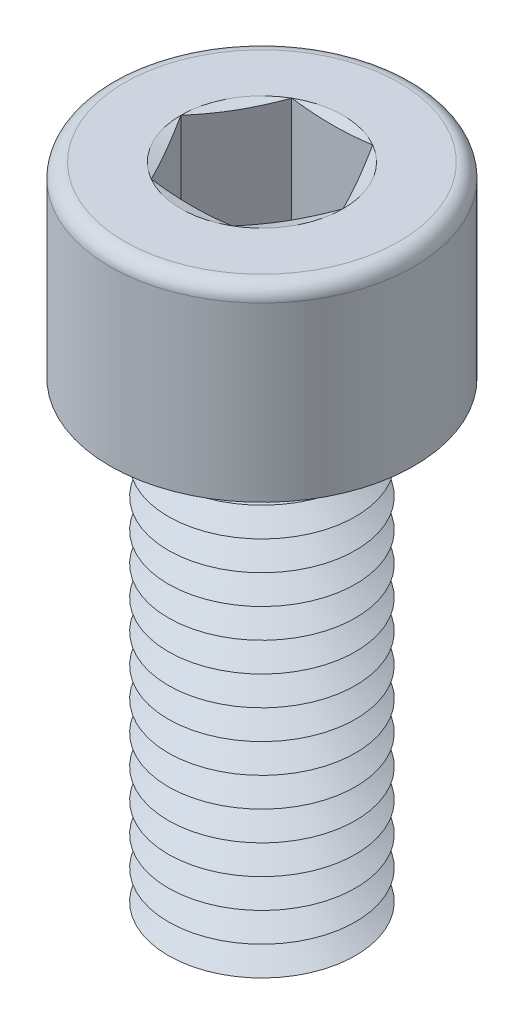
ISO-10303-21;
HEADER;
FILE_DESCRIPTION(('STEP AP214'),'2;1');
FILE_NAME('part.step','',(''),(''),'','','');
FILE_SCHEMA(('AUTOMOTIVE_DESIGN { 1 0 10303 214 1 1 1 1 }'));
ENDSEC;
DATA;
#1=APPLICATION_CONTEXT('core data for automotive mechanical design processes');
#2=APPLICATION_PROTOCOL_DEFINITION('international standard','automotive_design',2000,#1);
#3=PRODUCT_CONTEXT('',#1,'mechanical');
#4=PRODUCT('Part','Part','',(#3));
#5=PRODUCT_RELATED_PRODUCT_CATEGORY('part','',(#4));
#6=PRODUCT_DEFINITION_FORMATION('','',#4);
#7=PRODUCT_DEFINITION_CONTEXT('part definition',#1,'design');
#8=PRODUCT_DEFINITION('design','',#6,#7);
#9=PRODUCT_DEFINITION_SHAPE('','',#8);
#10=(LENGTH_UNIT() NAMED_UNIT(*) SI_UNIT(.MILLI.,.METRE.));
#11=(NAMED_UNIT(*) PLANE_ANGLE_UNIT() SI_UNIT($,.RADIAN.));
#12=(NAMED_UNIT(*) SI_UNIT($,.STERADIAN.) SOLID_ANGLE_UNIT());
#13=UNCERTAINTY_MEASURE_WITH_UNIT(LENGTH_MEASURE(1.E-05),#10,'distance_accuracy_value','');
#14=(GEOMETRIC_REPRESENTATION_CONTEXT(3) GLOBAL_UNCERTAINTY_ASSIGNED_CONTEXT((#13)) GLOBAL_UNIT_ASSIGNED_CONTEXT((#10,
#11,#12)) REPRESENTATION_CONTEXT('',''));
#15=CARTESIAN_POINT('',(0.,0.,0.));
#16=DIRECTION('',(0.,0.,1.));
#17=DIRECTION('',(1.,0.,0.));
#18=AXIS2_PLACEMENT_3D('',#15,#16,#17);
#19=CARTESIAN_POINT('',(0.,5.,0.));
#20=DIRECTION('',(0.,1.,0.));
#21=DIRECTION('',(0.,0.,1.));
#22=AXIS2_PLACEMENT_3D('',#19,#20,#21);
#23=CONICAL_SURFACE('',#22,2.91746824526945,1.0471975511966);
#24=CARTESIAN_POINT('',(0.,5.625,0.));
#25=DIRECTION('',(0.,1.,0.));
#26=DIRECTION('',(0.,0.,1.));
#27=AXIS2_PLACEMENT_3D('',#24,#25,#26);
#28=CIRCLE('',#27,4.);
#29=CARTESIAN_POINT('',(0.,5.625,4.));
#30=VERTEX_POINT('',#29);
#31=EDGE_CURVE('E437',#30,#30,#28,.T.);
#32=ORIENTED_EDGE('',*,*,#31,.F.);
#33=EDGE_LOOP('',(#32));
#34=FACE_BOUND('',#33,.T.);
#35=CARTESIAN_POINT('',(0.,5.,0.));
#36=DIRECTION('',(0.,1.,0.));
#37=DIRECTION('',(0.,0.,1.));
#38=AXIS2_PLACEMENT_3D('',#35,#36,#37);
#39=CIRCLE('',#38,2.91746824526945);
#40=CARTESIAN_POINT('',(0.,5.,2.91746824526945));
#41=VERTEX_POINT('',#40);
#42=EDGE_CURVE('E441',#41,#41,#39,.T.);
#43=ORIENTED_EDGE('',*,*,#42,.T.);
#44=EDGE_LOOP('',(#43));
#45=FACE_BOUND('',#44,.T.);
#46=ADVANCED_FACE('F41',(#34,#45),#23,.T.);
#47=CARTESIAN_POINT('',(0.,4.375,0.));
#48=DIRECTION('',(0.,-1.,0.));
#49=DIRECTION('',(0.,0.,-1.));
#50=AXIS2_PLACEMENT_3D('',#47,#48,#49);
#51=CONICAL_SURFACE('',#50,4.,1.0471975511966);
#52=ORIENTED_EDGE('',*,*,#42,.F.);
#53=EDGE_LOOP('',(#52));
#54=FACE_BOUND('',#53,.T.);
#55=CARTESIAN_POINT('',(0.,4.375,0.));
#56=DIRECTION('',(0.,1.,0.));
#57=DIRECTION('',(0.,0.,1.));
#58=AXIS2_PLACEMENT_3D('',#55,#56,#57);
#59=CIRCLE('',#58,4.);
#60=CARTESIAN_POINT('',(0.,4.375,4.));
#61=VERTEX_POINT('',#60);
#62=EDGE_CURVE('E445',#61,#61,#59,.T.);
#63=ORIENTED_EDGE('',*,*,#62,.T.);
#64=EDGE_LOOP('',(#63));
#65=FACE_BOUND('',#64,.T.);
#66=ADVANCED_FACE('F250',(#54,#65),#51,.T.);
#67=CARTESIAN_POINT('',(0.,0.,0.));
#68=DIRECTION('',(0.,1.,0.));
#69=DIRECTION('',(0.,0.,1.));
#70=AXIS2_PLACEMENT_3D('',#67,#68,#69);
#71=PLANE('',#70);
#72=CARTESIAN_POINT('',(0.,0.,0.));
#73=DIRECTION('',(0.,1.,0.));
#74=DIRECTION('',(0.,0.,1.));
#75=AXIS2_PLACEMENT_3D('',#72,#73,#74);
#76=CIRCLE('',#75,2.91746824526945);
#77=CARTESIAN_POINT('',(0.,0.,2.91746824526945));
#78=VERTEX_POINT('',#77);
#79=EDGE_CURVE('E473',#78,#78,#76,.T.);
#80=ORIENTED_EDGE('',*,*,#79,.F.);
#81=EDGE_LOOP('',(#80));
#82=FACE_BOUND('',#81,.T.);
#83=ADVANCED_FACE('F247',(#82),#71,.F.);
#84=CARTESIAN_POINT('',(0.,0.,0.));
#85=DIRECTION('',(0.,1.,0.));
#86=DIRECTION('',(0.,0.,1.));
#87=AXIS2_PLACEMENT_3D('',#84,#85,#86);
#88=CONICAL_SURFACE('',#87,2.91746824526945,1.0471975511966);
#89=CARTESIAN_POINT('',(0.,0.624999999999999,0.));
#90=DIRECTION('',(0.,1.,0.));
#91=DIRECTION('',(0.,0.,1.));
#92=AXIS2_PLACEMENT_3D('',#89,#90,#91);
#93=CIRCLE('',#92,4.);
#94=CARTESIAN_POINT('',(0.,0.624999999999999,4.));
#95=VERTEX_POINT('',#94);
#96=EDGE_CURVE('E469',#95,#95,#93,.T.);
#97=ORIENTED_EDGE('',*,*,#96,.F.);
#98=EDGE_LOOP('',(#97));
#99=FACE_BOUND('',#98,.T.);
#100=ORIENTED_EDGE('',*,*,#79,.T.);
#101=EDGE_LOOP('',(#100));
#102=FACE_BOUND('',#101,.T.);
#103=ADVANCED_FACE('F249',(#99,#102),#88,.T.);
#104=CARTESIAN_POINT('',(0.,0.624999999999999,0.));
#105=DIRECTION('',(0.,-1.,0.));
#106=DIRECTION('',(0.,0.,-1.));
#107=AXIS2_PLACEMENT_3D('',#104,#105,#106);
#108=CONICAL_SURFACE('',#107,4.,1.0471975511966);
#109=CARTESIAN_POINT('',(0.,1.25,0.));
#110=DIRECTION('',(0.,1.,0.));
#111=DIRECTION('',(0.,0.,1.));
#112=AXIS2_PLACEMENT_3D('',#109,#110,#111);
#113=CIRCLE('',#112,2.91746824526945);
#114=CARTESIAN_POINT('',(0.,1.25,2.91746824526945));
#115=VERTEX_POINT('',#114);
#116=EDGE_CURVE('E465',#115,#115,#113,.T.);
#117=ORIENTED_EDGE('',*,*,#116,.F.);
#118=EDGE_LOOP('',(#117));
#119=FACE_BOUND('',#118,.T.);
#120=ORIENTED_EDGE('',*,*,#96,.T.);
#121=EDGE_LOOP('',(#120));
#122=FACE_BOUND('',#121,.T.);
#123=ADVANCED_FACE('F290',(#119,#122),#108,.T.);
#124=CARTESIAN_POINT('',(0.,1.25,0.));
#125=DIRECTION('',(0.,1.,0.));
#126=DIRECTION('',(0.,0.,1.));
#127=AXIS2_PLACEMENT_3D('',#124,#125,#126);
#128=CONICAL_SURFACE('',#127,2.91746824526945,1.0471975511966);
#129=CARTESIAN_POINT('',(0.,1.875,0.));
#130=DIRECTION('',(0.,1.,0.));
#131=DIRECTION('',(0.,0.,1.));
#132=AXIS2_PLACEMENT_3D('',#129,#130,#131);
#133=CIRCLE('',#132,4.);
#134=CARTESIAN_POINT('',(0.,1.875,4.));
#135=VERTEX_POINT('',#134);
#136=EDGE_CURVE('E461',#135,#135,#133,.T.);
#137=ORIENTED_EDGE('',*,*,#136,.F.);
#138=EDGE_LOOP('',(#137));
#139=FACE_BOUND('',#138,.T.);
#140=ORIENTED_EDGE('',*,*,#116,.T.);
#141=EDGE_LOOP('',(#140));
#142=FACE_BOUND('',#141,.T.);
#143=ADVANCED_FACE('F285',(#139,#142),#128,.T.);
#144=CARTESIAN_POINT('',(0.,1.875,0.));
#145=DIRECTION('',(0.,-1.,0.));
#146=DIRECTION('',(0.,0.,-1.));
#147=AXIS2_PLACEMENT_3D('',#144,#145,#146);
#148=CONICAL_SURFACE('',#147,4.,1.0471975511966);
#149=CARTESIAN_POINT('',(0.,2.5,0.));
#150=DIRECTION('',(0.,1.,0.));
#151=DIRECTION('',(0.,0.,1.));
#152=AXIS2_PLACEMENT_3D('',#149,#150,#151);
#153=CIRCLE('',#152,2.91746824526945);
#154=CARTESIAN_POINT('',(0.,2.5,2.91746824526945));
#155=VERTEX_POINT('',#154);
#156=EDGE_CURVE('E457',#155,#155,#153,.T.);
#157=ORIENTED_EDGE('',*,*,#156,.F.);
#158=EDGE_LOOP('',(#157));
#159=FACE_BOUND('',#158,.T.);
#160=ORIENTED_EDGE('',*,*,#136,.T.);
#161=EDGE_LOOP('',(#160));
#162=FACE_BOUND('',#161,.T.);
#163=ADVANCED_FACE('F282',(#159,#162),#148,.T.);
#164=CARTESIAN_POINT('',(0.,2.5,0.));
#165=DIRECTION('',(0.,1.,0.));
#166=DIRECTION('',(0.,0.,1.));
#167=AXIS2_PLACEMENT_3D('',#164,#165,#166);
#168=CONICAL_SURFACE('',#167,2.91746824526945,1.0471975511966);
#169=CARTESIAN_POINT('',(0.,3.125,0.));
#170=DIRECTION('',(0.,1.,0.));
#171=DIRECTION('',(0.,0.,1.));
#172=AXIS2_PLACEMENT_3D('',#169,#170,#171);
#173=CIRCLE('',#172,4.);
#174=CARTESIAN_POINT('',(0.,3.125,4.));
#175=VERTEX_POINT('',#174);
#176=EDGE_CURVE('E453',#175,#175,#173,.T.);
#177=ORIENTED_EDGE('',*,*,#176,.F.);
#178=EDGE_LOOP('',(#177));
#179=FACE_BOUND('',#178,.T.);
#180=ORIENTED_EDGE('',*,*,#156,.T.);
#181=EDGE_LOOP('',(#180));
#182=FACE_BOUND('',#181,.T.);
#183=ADVANCED_FACE('F276',(#179,#182),#168,.T.);
#184=CARTESIAN_POINT('',(0.,3.125,0.));
#185=DIRECTION('',(0.,-1.,0.));
#186=DIRECTION('',(0.,0.,-1.));
#187=AXIS2_PLACEMENT_3D('',#184,#185,#186);
#188=CONICAL_SURFACE('',#187,4.,1.0471975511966);
#189=CARTESIAN_POINT('',(0.,3.75,0.));
#190=DIRECTION('',(0.,1.,0.));
#191=DIRECTION('',(0.,0.,1.));
#192=AXIS2_PLACEMENT_3D('',#189,#190,#191);
#193=CIRCLE('',#192,2.91746824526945);
#194=CARTESIAN_POINT('',(0.,3.75,2.91746824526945));
#195=VERTEX_POINT('',#194);
#196=EDGE_CURVE('E449',#195,#195,#193,.T.);
#197=ORIENTED_EDGE('',*,*,#196,.F.);
#198=EDGE_LOOP('',(#197));
#199=FACE_BOUND('',#198,.T.);
#200=ORIENTED_EDGE('',*,*,#176,.T.);
#201=EDGE_LOOP('',(#200));
#202=FACE_BOUND('',#201,.T.);
#203=ADVANCED_FACE('F272',(#199,#202),#188,.T.);
#204=CARTESIAN_POINT('',(0.,3.75,0.));
#205=DIRECTION('',(0.,1.,0.));
#206=DIRECTION('',(0.,0.,1.));
#207=AXIS2_PLACEMENT_3D('',#204,#205,#206);
#208=CONICAL_SURFACE('',#207,2.91746824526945,1.0471975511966);
#209=ORIENTED_EDGE('',*,*,#62,.F.);
#210=EDGE_LOOP('',(#209));
#211=FACE_BOUND('',#210,.T.);
#212=ORIENTED_EDGE('',*,*,#196,.T.);
#213=EDGE_LOOP('',(#212));
#214=FACE_BOUND('',#213,.T.);
#215=ADVANCED_FACE('F275',(#211,#214),#208,.T.);
#216=CARTESIAN_POINT('',(0.,6.25,0.));
#217=DIRECTION('',(0.,1.,0.));
#218=DIRECTION('',(0.,0.,1.));
#219=AXIS2_PLACEMENT_3D('',#216,#217,#218);
#220=CONICAL_SURFACE('',#219,2.91746824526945,1.0471975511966);
#221=CARTESIAN_POINT('',(0.,6.875,0.));
#222=DIRECTION('',(0.,1.,0.));
#223=DIRECTION('',(0.,0.,1.));
#224=AXIS2_PLACEMENT_3D('',#221,#222,#223);
#225=CIRCLE('',#224,4.);
#226=CARTESIAN_POINT('',(0.,6.875,4.));
#227=VERTEX_POINT('',#226);
#228=EDGE_CURVE('E430',#227,#227,#225,.T.);
#229=ORIENTED_EDGE('',*,*,#228,.F.);
#230=EDGE_LOOP('',(#229));
#231=FACE_BOUND('',#230,.T.);
#232=CARTESIAN_POINT('',(0.,6.25,0.));
#233=DIRECTION('',(0.,1.,0.));
#234=DIRECTION('',(0.,0.,1.));
#235=AXIS2_PLACEMENT_3D('',#232,#233,#234);
#236=CIRCLE('',#235,2.91746824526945);
#237=CARTESIAN_POINT('',(0.,6.25,2.91746824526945));
#238=VERTEX_POINT('',#237);
#239=EDGE_CURVE('E433',#238,#238,#236,.T.);
#240=ORIENTED_EDGE('',*,*,#239,.T.);
#241=EDGE_LOOP('',(#240));
#242=FACE_BOUND('',#241,.T.);
#243=ADVANCED_FACE('F280',(#231,#242),#220,.T.);
#244=CARTESIAN_POINT('',(0.,5.625,0.));
#245=DIRECTION('',(0.,-1.,0.));
#246=DIRECTION('',(0.,0.,-1.));
#247=AXIS2_PLACEMENT_3D('',#244,#245,#246);
#248=CONICAL_SURFACE('',#247,4.,1.0471975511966);
#249=ORIENTED_EDGE('',*,*,#239,.F.);
#250=EDGE_LOOP('',(#249));
#251=FACE_BOUND('',#250,.T.);
#252=ORIENTED_EDGE('',*,*,#31,.T.);
#253=EDGE_LOOP('',(#252));
#254=FACE_BOUND('',#253,.T.);
#255=ADVANCED_FACE('F717',(#251,#254),#248,.T.);
#256=CARTESIAN_POINT('',(0.,7.5,0.));
#257=DIRECTION('',(0.,1.,0.));
#258=DIRECTION('',(0.,0.,1.));
#259=AXIS2_PLACEMENT_3D('',#256,#257,#258);
#260=CONICAL_SURFACE('',#259,2.91746824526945,1.0471975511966);
#261=CARTESIAN_POINT('',(0.,8.125,0.));
#262=DIRECTION('',(0.,1.,0.));
#263=DIRECTION('',(0.,0.,1.));
#264=AXIS2_PLACEMENT_3D('',#261,#262,#263);
#265=CIRCLE('',#264,4.);
#266=CARTESIAN_POINT('',(0.,8.125,4.));
#267=VERTEX_POINT('',#266);
#268=EDGE_CURVE('E422',#267,#267,#265,.T.);
#269=ORIENTED_EDGE('',*,*,#268,.F.);
#270=EDGE_LOOP('',(#269));
#271=FACE_BOUND('',#270,.T.);
#272=CARTESIAN_POINT('',(0.,7.5,0.));
#273=DIRECTION('',(0.,1.,0.));
#274=DIRECTION('',(0.,0.,1.));
#275=AXIS2_PLACEMENT_3D('',#272,#273,#274);
#276=CIRCLE('',#275,2.91746824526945);
#277=CARTESIAN_POINT('',(0.,7.5,2.91746824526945));
#278=VERTEX_POINT('',#277);
#279=EDGE_CURVE('E426',#278,#278,#276,.T.);
#280=ORIENTED_EDGE('',*,*,#279,.T.);
#281=EDGE_LOOP('',(#280));
#282=FACE_BOUND('',#281,.T.);
#283=ADVANCED_FACE('F726',(#271,#282),#260,.T.);
#284=CARTESIAN_POINT('',(0.,6.875,0.));
#285=DIRECTION('',(0.,-1.,0.));
#286=DIRECTION('',(0.,0.,-1.));
#287=AXIS2_PLACEMENT_3D('',#284,#285,#286);
#288=CONICAL_SURFACE('',#287,4.,1.0471975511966);
#289=ORIENTED_EDGE('',*,*,#279,.F.);
#290=EDGE_LOOP('',(#289));
#291=FACE_BOUND('',#290,.T.);
#292=ORIENTED_EDGE('',*,*,#228,.T.);
#293=EDGE_LOOP('',(#292));
#294=FACE_BOUND('',#293,.T.);
#295=ADVANCED_FACE('F736',(#291,#294),#288,.T.);
#296=CARTESIAN_POINT('',(0.,8.75,0.));
#297=DIRECTION('',(0.,1.,0.));
#298=DIRECTION('',(0.,0.,1.));
#299=AXIS2_PLACEMENT_3D('',#296,#297,#298);
#300=CONICAL_SURFACE('',#299,2.91746824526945,1.0471975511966);
#301=CARTESIAN_POINT('',(0.,9.375,0.));
#302=DIRECTION('',(0.,1.,0.));
#303=DIRECTION('',(0.,0.,1.));
#304=AXIS2_PLACEMENT_3D('',#301,#302,#303);
#305=CIRCLE('',#304,4.);
#306=CARTESIAN_POINT('',(0.,9.375,4.));
#307=VERTEX_POINT('',#306);
#308=EDGE_CURVE('E414',#307,#307,#305,.T.);
#309=ORIENTED_EDGE('',*,*,#308,.F.);
#310=EDGE_LOOP('',(#309));
#311=FACE_BOUND('',#310,.T.);
#312=CARTESIAN_POINT('',(0.,8.75,0.));
#313=DIRECTION('',(0.,1.,0.));
#314=DIRECTION('',(0.,0.,1.));
#315=AXIS2_PLACEMENT_3D('',#312,#313,#314);
#316=CIRCLE('',#315,2.91746824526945);
#317=CARTESIAN_POINT('',(0.,8.75,2.91746824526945));
#318=VERTEX_POINT('',#317);
#319=EDGE_CURVE('E418',#318,#318,#316,.T.);
#320=ORIENTED_EDGE('',*,*,#319,.T.);
#321=EDGE_LOOP('',(#320));
#322=FACE_BOUND('',#321,.T.);
#323=ADVANCED_FACE('F746',(#311,#322),#300,.T.);
#324=CARTESIAN_POINT('',(0.,8.125,0.));
#325=DIRECTION('',(0.,-1.,0.));
#326=DIRECTION('',(0.,0.,-1.));
#327=AXIS2_PLACEMENT_3D('',#324,#325,#326);
#328=CONICAL_SURFACE('',#327,4.,1.0471975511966);
#329=ORIENTED_EDGE('',*,*,#319,.F.);
#330=EDGE_LOOP('',(#329));
#331=FACE_BOUND('',#330,.T.);
#332=ORIENTED_EDGE('',*,*,#268,.T.);
#333=EDGE_LOOP('',(#332));
#334=FACE_BOUND('',#333,.T.);
#335=ADVANCED_FACE('F756',(#331,#334),#328,.T.);
#336=CARTESIAN_POINT('',(0.,10.,0.));
#337=DIRECTION('',(0.,1.,0.));
#338=DIRECTION('',(0.,0.,1.));
#339=AXIS2_PLACEMENT_3D('',#336,#337,#338);
#340=CONICAL_SURFACE('',#339,2.91746824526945,1.0471975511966);
#341=CARTESIAN_POINT('',(0.,10.625,0.));
#342=DIRECTION('',(0.,1.,0.));
#343=DIRECTION('',(0.,0.,1.));
#344=AXIS2_PLACEMENT_3D('',#341,#342,#343);
#345=CIRCLE('',#344,4.);
#346=CARTESIAN_POINT('',(0.,10.625,4.));
#347=VERTEX_POINT('',#346);
#348=EDGE_CURVE('E406',#347,#347,#345,.T.);
#349=ORIENTED_EDGE('',*,*,#348,.F.);
#350=EDGE_LOOP('',(#349));
#351=FACE_BOUND('',#350,.T.);
#352=CARTESIAN_POINT('',(0.,10.,0.));
#353=DIRECTION('',(0.,1.,0.));
#354=DIRECTION('',(0.,0.,1.));
#355=AXIS2_PLACEMENT_3D('',#352,#353,#354);
#356=CIRCLE('',#355,2.91746824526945);
#357=CARTESIAN_POINT('',(0.,10.,2.91746824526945));
#358=VERTEX_POINT('',#357);
#359=EDGE_CURVE('E410',#358,#358,#356,.T.);
#360=ORIENTED_EDGE('',*,*,#359,.T.);
#361=EDGE_LOOP('',(#360));
#362=FACE_BOUND('',#361,.T.);
#363=ADVANCED_FACE('F766',(#351,#362),#340,.T.);
#364=CARTESIAN_POINT('',(0.,9.375,0.));
#365=DIRECTION('',(0.,-1.,0.));
#366=DIRECTION('',(0.,0.,-1.));
#367=AXIS2_PLACEMENT_3D('',#364,#365,#366);
#368=CONICAL_SURFACE('',#367,4.,1.0471975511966);
#369=ORIENTED_EDGE('',*,*,#359,.F.);
#370=EDGE_LOOP('',(#369));
#371=FACE_BOUND('',#370,.T.);
#372=ORIENTED_EDGE('',*,*,#308,.T.);
#373=EDGE_LOOP('',(#372));
#374=FACE_BOUND('',#373,.T.);
#375=ADVANCED_FACE('F776',(#371,#374),#368,.T.);
#376=CARTESIAN_POINT('',(0.,11.25,0.));
#377=DIRECTION('',(0.,1.,0.));
#378=DIRECTION('',(0.,0.,1.));
#379=AXIS2_PLACEMENT_3D('',#376,#377,#378);
#380=CONICAL_SURFACE('',#379,2.91746824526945,1.0471975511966);
#381=CARTESIAN_POINT('',(0.,11.875,0.));
#382=DIRECTION('',(0.,1.,0.));
#383=DIRECTION('',(0.,0.,1.));
#384=AXIS2_PLACEMENT_3D('',#381,#382,#383);
#385=CIRCLE('',#384,4.);
#386=CARTESIAN_POINT('',(0.,11.875,4.));
#387=VERTEX_POINT('',#386);
#388=EDGE_CURVE('E398',#387,#387,#385,.T.);
#389=ORIENTED_EDGE('',*,*,#388,.F.);
#390=EDGE_LOOP('',(#389));
#391=FACE_BOUND('',#390,.T.);
#392=CARTESIAN_POINT('',(0.,11.25,0.));
#393=DIRECTION('',(0.,1.,0.));
#394=DIRECTION('',(0.,0.,1.));
#395=AXIS2_PLACEMENT_3D('',#392,#393,#394);
#396=CIRCLE('',#395,2.91746824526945);
#397=CARTESIAN_POINT('',(0.,11.25,2.91746824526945));
#398=VERTEX_POINT('',#397);
#399=EDGE_CURVE('E402',#398,#398,#396,.T.);
#400=ORIENTED_EDGE('',*,*,#399,.T.);
#401=EDGE_LOOP('',(#400));
#402=FACE_BOUND('',#401,.T.);
#403=ADVANCED_FACE('F786',(#391,#402),#380,.T.);
#404=CARTESIAN_POINT('',(0.,10.625,0.));
#405=DIRECTION('',(0.,-1.,0.));
#406=DIRECTION('',(0.,0.,-1.));
#407=AXIS2_PLACEMENT_3D('',#404,#405,#406);
#408=CONICAL_SURFACE('',#407,4.,1.0471975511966);
#409=ORIENTED_EDGE('',*,*,#399,.F.);
#410=EDGE_LOOP('',(#409));
#411=FACE_BOUND('',#410,.T.);
#412=ORIENTED_EDGE('',*,*,#348,.T.);
#413=EDGE_LOOP('',(#412));
#414=FACE_BOUND('',#413,.T.);
#415=ADVANCED_FACE('F796',(#411,#414),#408,.T.);
#416=CARTESIAN_POINT('',(0.,12.5,0.));
#417=DIRECTION('',(0.,1.,0.));
#418=DIRECTION('',(0.,0.,1.));
#419=AXIS2_PLACEMENT_3D('',#416,#417,#418);
#420=CONICAL_SURFACE('',#419,2.91746824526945,1.0471975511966);
#421=CARTESIAN_POINT('',(0.,13.125,0.));
#422=DIRECTION('',(0.,1.,0.));
#423=DIRECTION('',(0.,0.,1.));
#424=AXIS2_PLACEMENT_3D('',#421,#422,#423);
#425=CIRCLE('',#424,4.);
#426=CARTESIAN_POINT('',(0.,13.125,4.));
#427=VERTEX_POINT('',#426);
#428=EDGE_CURVE('E390',#427,#427,#425,.T.);
#429=ORIENTED_EDGE('',*,*,#428,.F.);
#430=EDGE_LOOP('',(#429));
#431=FACE_BOUND('',#430,.T.);
#432=CARTESIAN_POINT('',(0.,12.5,0.));
#433=DIRECTION('',(0.,1.,0.));
#434=DIRECTION('',(0.,0.,1.));
#435=AXIS2_PLACEMENT_3D('',#432,#433,#434);
#436=CIRCLE('',#435,2.91746824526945);
#437=CARTESIAN_POINT('',(0.,12.5,2.91746824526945));
#438=VERTEX_POINT('',#437);
#439=EDGE_CURVE('E394',#438,#438,#436,.T.);
#440=ORIENTED_EDGE('',*,*,#439,.T.);
#441=EDGE_LOOP('',(#440));
#442=FACE_BOUND('',#441,.T.);
#443=ADVANCED_FACE('F806',(#431,#442),#420,.T.);
#444=CARTESIAN_POINT('',(0.,11.875,0.));
#445=DIRECTION('',(0.,-1.,0.));
#446=DIRECTION('',(0.,0.,-1.));
#447=AXIS2_PLACEMENT_3D('',#444,#445,#446);
#448=CONICAL_SURFACE('',#447,4.,1.0471975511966);
#449=ORIENTED_EDGE('',*,*,#439,.F.);
#450=EDGE_LOOP('',(#449));
#451=FACE_BOUND('',#450,.T.);
#452=ORIENTED_EDGE('',*,*,#388,.T.);
#453=EDGE_LOOP('',(#452));
#454=FACE_BOUND('',#453,.T.);
#455=ADVANCED_FACE('F816',(#451,#454),#448,.T.);
#456=CARTESIAN_POINT('',(0.,13.75,0.));
#457=DIRECTION('',(0.,1.,0.));
#458=DIRECTION('',(0.,0.,1.));
#459=AXIS2_PLACEMENT_3D('',#456,#457,#458);
#460=CONICAL_SURFACE('',#459,2.91746824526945,1.0471975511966);
#461=CARTESIAN_POINT('',(0.,14.375,0.));
#462=DIRECTION('',(0.,1.,0.));
#463=DIRECTION('',(0.,0.,1.));
#464=AXIS2_PLACEMENT_3D('',#461,#462,#463);
#465=CIRCLE('',#464,4.);
#466=CARTESIAN_POINT('',(0.,14.375,4.));
#467=VERTEX_POINT('',#466);
#468=EDGE_CURVE('E383',#467,#467,#465,.T.);
#469=ORIENTED_EDGE('',*,*,#468,.F.);
#470=EDGE_LOOP('',(#469));
#471=FACE_BOUND('',#470,.T.);
#472=CARTESIAN_POINT('',(0.,13.75,0.));
#473=DIRECTION('',(0.,1.,0.));
#474=DIRECTION('',(0.,0.,1.));
#475=AXIS2_PLACEMENT_3D('',#472,#473,#474);
#476=CIRCLE('',#475,2.91746824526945);
#477=CARTESIAN_POINT('',(0.,13.75,2.91746824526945));
#478=VERTEX_POINT('',#477);
#479=EDGE_CURVE('E386',#478,#478,#476,.T.);
#480=ORIENTED_EDGE('',*,*,#479,.T.);
#481=EDGE_LOOP('',(#480));
#482=FACE_BOUND('',#481,.T.);
#483=ADVANCED_FACE('F826',(#471,#482),#460,.T.);
#484=CARTESIAN_POINT('',(0.,13.125,0.));
#485=DIRECTION('',(0.,-1.,0.));
#486=DIRECTION('',(0.,0.,-1.));
#487=AXIS2_PLACEMENT_3D('',#484,#485,#486);
#488=CONICAL_SURFACE('',#487,4.,1.0471975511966);
#489=ORIENTED_EDGE('',*,*,#479,.F.);
#490=EDGE_LOOP('',(#489));
#491=FACE_BOUND('',#490,.T.);
#492=ORIENTED_EDGE('',*,*,#428,.T.);
#493=EDGE_LOOP('',(#492));
#494=FACE_BOUND('',#493,.T.);
#495=ADVANCED_FACE('F836',(#491,#494),#488,.T.);
#496=CARTESIAN_POINT('',(0.,15.,0.));
#497=DIRECTION('',(0.,1.,0.));
#498=DIRECTION('',(0.,0.,1.));
#499=AXIS2_PLACEMENT_3D('',#496,#497,#498);
#500=CONICAL_SURFACE('',#499,2.91746824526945,1.0471975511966);
#501=CARTESIAN_POINT('',(0.,15.625,0.));
#502=DIRECTION('',(0.,1.,0.));
#503=DIRECTION('',(0.,0.,1.));
#504=AXIS2_PLACEMENT_3D('',#501,#502,#503);
#505=CIRCLE('',#504,4.);
#506=CARTESIAN_POINT('',(0.,15.625,4.));
#507=VERTEX_POINT('',#506);
#508=EDGE_CURVE('E375',#507,#507,#505,.T.);
#509=ORIENTED_EDGE('',*,*,#508,.F.);
#510=EDGE_LOOP('',(#509));
#511=FACE_BOUND('',#510,.T.);
#512=CARTESIAN_POINT('',(0.,15.,0.));
#513=DIRECTION('',(0.,1.,0.));
#514=DIRECTION('',(0.,0.,1.));
#515=AXIS2_PLACEMENT_3D('',#512,#513,#514);
#516=CIRCLE('',#515,2.91746824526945);
#517=CARTESIAN_POINT('',(0.,15.,2.91746824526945));
#518=VERTEX_POINT('',#517);
#519=EDGE_CURVE('E379',#518,#518,#516,.T.);
#520=ORIENTED_EDGE('',*,*,#519,.T.);
#521=EDGE_LOOP('',(#520));
#522=FACE_BOUND('',#521,.T.);
#523=ADVANCED_FACE('F846',(#511,#522),#500,.T.);
#524=CARTESIAN_POINT('',(0.,14.375,0.));
#525=DIRECTION('',(0.,-1.,0.));
#526=DIRECTION('',(0.,0.,-1.));
#527=AXIS2_PLACEMENT_3D('',#524,#525,#526);
#528=CONICAL_SURFACE('',#527,4.,1.0471975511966);
#529=ORIENTED_EDGE('',*,*,#519,.F.);
#530=EDGE_LOOP('',(#529));
#531=FACE_BOUND('',#530,.T.);
#532=ORIENTED_EDGE('',*,*,#468,.T.);
#533=EDGE_LOOP('',(#532));
#534=FACE_BOUND('',#533,.T.);
#535=ADVANCED_FACE('F856',(#531,#534),#528,.T.);
#536=CARTESIAN_POINT('',(0.,16.25,0.));
#537=DIRECTION('',(0.,1.,0.));
#538=DIRECTION('',(0.,0.,1.));
#539=AXIS2_PLACEMENT_3D('',#536,#537,#538);
#540=CONICAL_SURFACE('',#539,2.91746824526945,1.0471975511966);
#541=CARTESIAN_POINT('',(0.,16.875,0.));
#542=DIRECTION('',(0.,1.,0.));
#543=DIRECTION('',(0.,0.,1.));
#544=AXIS2_PLACEMENT_3D('',#541,#542,#543);
#545=CIRCLE('',#544,4.);
#546=CARTESIAN_POINT('',(0.,16.875,4.));
#547=VERTEX_POINT('',#546);
#548=EDGE_CURVE('E367',#547,#547,#545,.T.);
#549=ORIENTED_EDGE('',*,*,#548,.F.);
#550=EDGE_LOOP('',(#549));
#551=FACE_BOUND('',#550,.T.);
#552=CARTESIAN_POINT('',(0.,16.25,0.));
#553=DIRECTION('',(0.,1.,0.));
#554=DIRECTION('',(0.,0.,1.));
#555=AXIS2_PLACEMENT_3D('',#552,#553,#554);
#556=CIRCLE('',#555,2.91746824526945);
#557=CARTESIAN_POINT('',(0.,16.25,2.91746824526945));
#558=VERTEX_POINT('',#557);
#559=EDGE_CURVE('E371',#558,#558,#556,.T.);
#560=ORIENTED_EDGE('',*,*,#559,.T.);
#561=EDGE_LOOP('',(#560));
#562=FACE_BOUND('',#561,.T.);
#563=ADVANCED_FACE('F866',(#551,#562),#540,.T.);
#564=CARTESIAN_POINT('',(0.,15.625,0.));
#565=DIRECTION('',(0.,-1.,0.));
#566=DIRECTION('',(0.,0.,-1.));
#567=AXIS2_PLACEMENT_3D('',#564,#565,#566);
#568=CONICAL_SURFACE('',#567,4.,1.0471975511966);
#569=ORIENTED_EDGE('',*,*,#559,.F.);
#570=EDGE_LOOP('',(#569));
#571=FACE_BOUND('',#570,.T.);
#572=ORIENTED_EDGE('',*,*,#508,.T.);
#573=EDGE_LOOP('',(#572));
#574=FACE_BOUND('',#573,.T.);
#575=ADVANCED_FACE('F876',(#571,#574),#568,.T.);
#576=CARTESIAN_POINT('',(0.,17.5,0.));
#577=DIRECTION('',(0.,1.,0.));
#578=DIRECTION('',(0.,0.,1.));
#579=AXIS2_PLACEMENT_3D('',#576,#577,#578);
#580=CONICAL_SURFACE('',#579,2.91746824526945,1.0471975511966);
#581=CARTESIAN_POINT('',(0.,18.125,0.));
#582=DIRECTION('',(0.,1.,0.));
#583=DIRECTION('',(0.,0.,1.));
#584=AXIS2_PLACEMENT_3D('',#581,#582,#583);
#585=CIRCLE('',#584,4.);
#586=CARTESIAN_POINT('',(0.,18.125,4.));
#587=VERTEX_POINT('',#586);
#588=EDGE_CURVE('E351',#587,#587,#585,.T.);
#589=ORIENTED_EDGE('',*,*,#588,.F.);
#590=EDGE_LOOP('',(#589));
#591=FACE_BOUND('',#590,.T.);
#592=CARTESIAN_POINT('',(0.,17.5,0.));
#593=DIRECTION('',(0.,1.,0.));
#594=DIRECTION('',(0.,0.,1.));
#595=AXIS2_PLACEMENT_3D('',#592,#593,#594);
#596=CIRCLE('',#595,2.91746824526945);
#597=CARTESIAN_POINT('',(0.,17.5,2.91746824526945));
#598=VERTEX_POINT('',#597);
#599=EDGE_CURVE('E363',#598,#598,#596,.T.);
#600=ORIENTED_EDGE('',*,*,#599,.T.);
#601=EDGE_LOOP('',(#600));
#602=FACE_BOUND('',#601,.T.);
#603=ADVANCED_FACE('F886',(#591,#602),#580,.T.);
#604=CARTESIAN_POINT('',(0.,16.875,0.));
#605=DIRECTION('',(0.,-1.,0.));
#606=DIRECTION('',(0.,0.,-1.));
#607=AXIS2_PLACEMENT_3D('',#604,#605,#606);
#608=CONICAL_SURFACE('',#607,4.,1.0471975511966);
#609=ORIENTED_EDGE('',*,*,#599,.F.);
#610=EDGE_LOOP('',(#609));
#611=FACE_BOUND('',#610,.T.);
#612=ORIENTED_EDGE('',*,*,#548,.T.);
#613=EDGE_LOOP('',(#612));
#614=FACE_BOUND('',#613,.T.);
#615=ADVANCED_FACE('F896',(#611,#614),#608,.T.);
#616=CARTESIAN_POINT('',(0.,18.75,0.));
#617=DIRECTION('',(0.,1.,0.));
#618=DIRECTION('',(0.,0.,1.));
#619=AXIS2_PLACEMENT_3D('',#616,#617,#618);
#620=CONICAL_SURFACE('',#619,2.91746824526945,1.0471975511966);
#621=CARTESIAN_POINT('',(0.,19.375,0.));
#622=DIRECTION('',(0.,1.,0.));
#623=DIRECTION('',(0.,0.,1.));
#624=AXIS2_PLACEMENT_3D('',#621,#622,#623);
#625=CIRCLE('',#624,4.);
#626=CARTESIAN_POINT('',(0.,19.375,4.));
#627=VERTEX_POINT('',#626);
#628=EDGE_CURVE('E358',#627,#627,#625,.T.);
#629=ORIENTED_EDGE('',*,*,#628,.F.);
#630=EDGE_LOOP('',(#629));
#631=FACE_BOUND('',#630,.T.);
#632=CARTESIAN_POINT('',(0.,18.75,0.));
#633=DIRECTION('',(0.,1.,0.));
#634=DIRECTION('',(0.,0.,1.));
#635=AXIS2_PLACEMENT_3D('',#632,#633,#634);
#636=CIRCLE('',#635,2.91746824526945);
#637=CARTESIAN_POINT('',(0.,18.75,2.91746824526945));
#638=VERTEX_POINT('',#637);
#639=EDGE_CURVE('E347',#638,#638,#636,.T.);
#640=ORIENTED_EDGE('',*,*,#639,.T.);
#641=EDGE_LOOP('',(#640));
#642=FACE_BOUND('',#641,.T.);
#643=ADVANCED_FACE('F906',(#631,#642),#620,.T.);
#644=CARTESIAN_POINT('',(0.,18.125,0.));
#645=DIRECTION('',(0.,-1.,0.));
#646=DIRECTION('',(0.,0.,-1.));
#647=AXIS2_PLACEMENT_3D('',#644,#645,#646);
#648=CONICAL_SURFACE('',#647,4.,1.0471975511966);
#649=ORIENTED_EDGE('',*,*,#639,.F.);
#650=EDGE_LOOP('',(#649));
#651=FACE_BOUND('',#650,.T.);
#652=ORIENTED_EDGE('',*,*,#588,.T.);
#653=EDGE_LOOP('',(#652));
#654=FACE_BOUND('',#653,.T.);
#655=ADVANCED_FACE('F194',(#651,#654),#648,.T.);
#656=CARTESIAN_POINT('',(0.,28.,0.));
#657=DIRECTION('',(0.,1.,0.));
#658=DIRECTION('',(0.,0.,1.));
#659=AXIS2_PLACEMENT_3D('',#656,#657,#658);
#660=PLANE('',#659);
#661=CARTESIAN_POINT('',(0.,28.,0.));
#662=DIRECTION('',(0.,1.,0.));
#663=DIRECTION('',(0.,0.,1.));
#664=AXIS2_PLACEMENT_3D('',#661,#662,#663);
#665=CIRCLE('',#664,3.46410161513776);
#666=CARTESIAN_POINT('',(1.73205080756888,28.,3.));
#667=VERTEX_POINT('',#666);
#668=CARTESIAN_POINT('',(3.46410161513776,28.,0.));
#669=VERTEX_POINT('',#668);
#670=EDGE_CURVE('E121',#667,#669,#665,.T.);
#671=ORIENTED_EDGE('',*,*,#670,.F.);
#672=CARTESIAN_POINT('',(0.,28.,0.));
#673=DIRECTION('',(0.,1.,0.));
#674=DIRECTION('',(0.,0.,1.));
#675=AXIS2_PLACEMENT_3D('',#672,#673,#674);
#676=CIRCLE('',#675,3.46410161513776);
#677=CARTESIAN_POINT('',(-1.73205080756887,28.,3.));
#678=VERTEX_POINT('',#677);
#679=EDGE_CURVE('E45',#678,#667,#676,.T.);
#680=ORIENTED_EDGE('',*,*,#679,.F.);
#681=CARTESIAN_POINT('',(-3.46410161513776,28.,0.));
#682=VERTEX_POINT('',#681);
#683=EDGE_CURVE('E138',#682,#678,#676,.T.);
#684=ORIENTED_EDGE('',*,*,#683,.F.);
#685=CARTESIAN_POINT('',(-1.73205080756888,28.,-3.));
#686=VERTEX_POINT('',#685);
#687=EDGE_CURVE('E554',#686,#682,#676,.T.);
#688=ORIENTED_EDGE('',*,*,#687,.F.);
#689=CARTESIAN_POINT('',(1.73205080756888,28.,-3.));
#690=VERTEX_POINT('',#689);
#691=EDGE_CURVE('E51',#690,#686,#676,.T.);
#692=ORIENTED_EDGE('',*,*,#691,.F.);
#693=EDGE_CURVE('E11',#669,#690,#676,.T.);
#694=ORIENTED_EDGE('',*,*,#693,.F.);
#695=EDGE_LOOP('',(#671,#680,#684,#688,#692,#694));
#696=FACE_BOUND('',#695,.T.);
#697=CARTESIAN_POINT('',(0.,28.,0.));
#698=DIRECTION('',(0.,1.,0.));
#699=DIRECTION('',(0.,0.,1.));
#700=AXIS2_PLACEMENT_3D('',#697,#698,#699);
#701=CIRCLE('',#700,5.875);
#702=CARTESIAN_POINT('',(0.,28.,5.875));
#703=VERTEX_POINT('',#702);
#704=EDGE_CURVE('E517',#703,#703,#701,.T.);
#705=ORIENTED_EDGE('',*,*,#704,.T.);
#706=EDGE_LOOP('',(#705));
#707=FACE_BOUND('',#706,.T.);
#708=ADVANCED_FACE('F140',(#696,#707),#660,.T.);
#709=CARTESIAN_POINT('',(0.,27.375,0.));
#710=DIRECTION('',(0.,1.,0.));
#711=DIRECTION('',(0.,0.,1.));
#712=AXIS2_PLACEMENT_3D('',#709,#710,#711);
#713=TOROIDAL_SURFACE('',#712,5.875,0.625);
#714=CARTESIAN_POINT('',(0.,27.375,0.));
#715=DIRECTION('',(0.,1.,0.));
#716=DIRECTION('',(0.,0.,1.));
#717=AXIS2_PLACEMENT_3D('',#714,#715,#716);
#718=CIRCLE('',#717,6.5);
#719=CARTESIAN_POINT('',(0.,27.375,6.5));
#720=VERTEX_POINT('',#719);
#721=EDGE_CURVE('E521',#720,#720,#718,.F.);
#722=ORIENTED_EDGE('',*,*,#721,.F.);
#723=EDGE_LOOP('',(#722));
#724=FACE_BOUND('',#723,.T.);
#725=ORIENTED_EDGE('',*,*,#704,.F.);
#726=EDGE_LOOP('',(#725));
#727=FACE_BOUND('',#726,.T.);
#728=ADVANCED_FACE('F43',(#724,#727),#713,.T.);
#729=CARTESIAN_POINT('',(0.,28.,0.));
#730=DIRECTION('',(0.,-1.,0.));
#731=DIRECTION('',(0.,0.,-1.));
#732=AXIS2_PLACEMENT_3D('',#729,#730,#731);
#733=CYLINDRICAL_SURFACE('',#732,6.5);
#734=ORIENTED_EDGE('',*,*,#721,.T.);
#735=EDGE_LOOP('',(#734));
#736=FACE_BOUND('',#735,.T.);
#737=CARTESIAN_POINT('',(0.,20.,0.));
#738=DIRECTION('',(0.,1.,0.));
#739=DIRECTION('',(0.,0.,1.));
#740=AXIS2_PLACEMENT_3D('',#737,#738,#739);
#741=CIRCLE('',#740,6.5);
#742=CARTESIAN_POINT('',(0.,20.,6.5));
#743=VERTEX_POINT('',#742);
#744=EDGE_CURVE('E504',#743,#743,#741,.T.);
#745=ORIENTED_EDGE('',*,*,#744,.T.);
#746=EDGE_LOOP('',(#745));
#747=FACE_BOUND('',#746,.T.);
#748=ADVANCED_FACE('F242',(#736,#747),#733,.T.);
#749=CARTESIAN_POINT('',(0.,20.,0.));
#750=DIRECTION('',(0.,1.,0.));
#751=DIRECTION('',(0.,0.,1.));
#752=AXIS2_PLACEMENT_3D('',#749,#750,#751);
#753=PLANE('',#752);
#754=ORIENTED_EDGE('',*,*,#744,.F.);
#755=EDGE_LOOP('',(#754));
#756=FACE_BOUND('',#755,.T.);
#757=CARTESIAN_POINT('',(0.,20.,0.));
#758=DIRECTION('',(0.,1.,0.));
#759=DIRECTION('',(0.,0.,1.));
#760=AXIS2_PLACEMENT_3D('',#757,#758,#759);
#761=CIRCLE('',#760,4.);
#762=CARTESIAN_POINT('',(0.,20.,4.));
#763=VERTEX_POINT('',#762);
#764=EDGE_CURVE('E513',#763,#763,#761,.T.);
#765=ORIENTED_EDGE('',*,*,#764,.T.);
#766=EDGE_LOOP('',(#765));
#767=FACE_BOUND('',#766,.T.);
#768=ADVANCED_FACE('F238',(#756,#767),#753,.F.);
#769=CARTESIAN_POINT('',(0.,20.,0.));
#770=DIRECTION('',(0.,-1.,0.));
#771=DIRECTION('',(0.,0.,-1.));
#772=AXIS2_PLACEMENT_3D('',#769,#770,#771);
#773=CYLINDRICAL_SURFACE('',#772,4.);
#774=ORIENTED_EDGE('',*,*,#628,.T.);
#775=EDGE_LOOP('',(#774));
#776=FACE_BOUND('',#775,.T.);
#777=ORIENTED_EDGE('',*,*,#764,.F.);
#778=EDGE_LOOP('',(#777));
#779=FACE_BOUND('',#778,.T.);
#780=ADVANCED_FACE('F241',(#776,#779),#773,.T.);
#781=CARTESIAN_POINT('',(0.,28.,0.));
#782=DIRECTION('',(0.,1.,0.));
#783=DIRECTION('',(0.,0.,1.));
#784=AXIS2_PLACEMENT_3D('',#781,#782,#783);
#785=CONICAL_SURFACE('',#784,3.46410161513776,1.30899693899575);
#786=ORIENTED_EDGE('',*,*,#679,.T.);
#787=CARTESIAN_POINT('',(-4.52161137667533,28.5257753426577,3.));
#788=CARTESIAN_POINT('',(-4.38614690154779,28.4955374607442,3.));
#789=CARTESIAN_POINT('',(-4.25059605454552,28.4656802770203,3.));
#790=CARTESIAN_POINT('',(-3.97927914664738,28.4069313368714,3.));
#791=CARTESIAN_POINT('',(-3.84351307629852,28.3780396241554,3.));
#792=CARTESIAN_POINT('',(-3.57159492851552,28.3213991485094,3.));
#793=CARTESIAN_POINT('',(-3.43544259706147,28.2936515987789,3.));
#794=CARTESIAN_POINT('',(-3.16285056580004,28.2396142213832,3.));
#795=CARTESIAN_POINT('',(-3.02641086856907,28.213324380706,3.));
#796=CARTESIAN_POINT('',(-2.61896324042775,28.1375690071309,3.));
#797=CARTESIAN_POINT('',(-2.34745999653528,28.0907136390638,3.));
#798=CARTESIAN_POINT('',(-1.80279754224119,28.0077090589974,3.));
#799=CARTESIAN_POINT('',(-1.52963867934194,27.9715576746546,3.));
#800=CARTESIAN_POINT('',(-1.11712206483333,27.9288850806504,3.));
#801=CARTESIAN_POINT('',(-0.978367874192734,27.9165506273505,3.));
#802=CARTESIAN_POINT('',(-0.700531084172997,27.8964911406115,3.));
#803=CARTESIAN_POINT('',(-0.561448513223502,27.8887657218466,3.));
#804=CARTESIAN_POINT('',(-0.283146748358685,27.8783731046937,3.));
#805=CARTESIAN_POINT('',(-0.1439276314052,27.8757038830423,3.));
#806=CARTESIAN_POINT('',(0.134513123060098,27.8755867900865,3.));
#807=CARTESIAN_POINT('',(0.273734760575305,27.8781389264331,3.));
#808=CARTESIAN_POINT('',(0.552556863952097,27.8883235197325,3.));
#809=CARTESIAN_POINT('',(0.692156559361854,27.8959766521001,3.));
#810=CARTESIAN_POINT('',(0.971024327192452,27.9159351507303,3.));
#811=CARTESIAN_POINT('',(1.11029238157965,27.928240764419,3.));
#812=CARTESIAN_POINT('',(1.3884939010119,27.9568974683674,3.));
#813=CARTESIAN_POINT('',(1.52742710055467,27.9732510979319,3.));
#814=CARTESIAN_POINT('',(1.80484805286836,28.0093419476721,3.));
#815=CARTESIAN_POINT('',(1.94333580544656,28.0290791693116,3.));
#816=CARTESIAN_POINT('',(2.2235029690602,28.0718742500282,3.));
#817=CARTESIAN_POINT('',(2.36517107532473,28.0950054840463,3.));
#818=CARTESIAN_POINT('',(2.648104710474,28.143617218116,3.));
#819=CARTESIAN_POINT('',(2.78937022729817,28.1690977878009,3.));
#820=CARTESIAN_POINT('',(3.21267286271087,28.2483421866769,3.));
#821=CARTESIAN_POINT('',(3.49418463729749,28.304903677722,3.));
#822=CARTESIAN_POINT('',(4.05626646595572,28.4228276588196,3.));
#823=CARTESIAN_POINT('',(4.33683622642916,28.4841915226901,3.));
#824=CARTESIAN_POINT('',(4.89726247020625,28.6101124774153,3.));
#825=CARTESIAN_POINT('',(5.17711893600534,28.6746696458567,3.));
#826=CARTESIAN_POINT('',(5.73290235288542,28.8051717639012,3.));
#827=CARTESIAN_POINT('',(6.00883557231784,28.871090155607,3.));
#828=CARTESIAN_POINT('',(6.56033924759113,29.0044513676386,3.));
#829=CARTESIAN_POINT('',(6.83590969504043,29.0718942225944,3.));
#830=CARTESIAN_POINT('',(7.38639195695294,29.2077957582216,3.));
#831=CARTESIAN_POINT('',(7.66130415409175,29.2762528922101,3.));
#832=CARTESIAN_POINT('',(8.21090603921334,29.4140133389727,3.));
#833=CARTESIAN_POINT('',(8.48559573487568,29.4833166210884,3.));
#834=CARTESIAN_POINT('',(8.76020986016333,29.5529148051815,3.));
#835=B_SPLINE_CURVE_WITH_KNOTS('',3,(#787,#788,#789,#790,#791,#792,#793,#794,#795,#796,#797,
#798,#799,#800,#801,#802,#803,#804,#805,#806,#807,#808,#809,#810,#811,#812,#813,#814,#815,#816,
#817,#818,#819,#820,#821,#822,#823,#824,#825,#826,#827,#828,#829,#830,#831,#832,#833,#834),
.UNSPECIFIED.,.F.,.F.,(4,2,2,2,2,2,2,2,2,2,2,2,2,2,2,2,2,2,2,2,2,2,2,4),(0.,0.416396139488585,
0.832811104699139,1.24965681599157,1.66649880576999,2.49292514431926,3.31918364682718,
3.73702338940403,4.1548281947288,4.5724657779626,4.99010397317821,5.40944532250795,
5.8288089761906,6.24843636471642,6.66806393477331,7.0986715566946,7.52929194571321,
8.39062817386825,9.25221171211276,10.1138161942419,10.9649037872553,11.8160107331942,
12.6659315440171,13.5158216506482),.UNSPECIFIED.);
#836=EDGE_CURVE('E127',#678,#667,#835,.T.);
#837=ORIENTED_EDGE('',*,*,#836,.F.);
#838=EDGE_LOOP('',(#786,#837));
#839=FACE_BOUND('',#838,.T.);
#840=ADVANCED_FACE('F132',(#839),#785,.F.);
#841=ORIENTED_EDGE('',*,*,#683,.T.);
#842=CARTESIAN_POINT('',(-3.46421708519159,28.0000309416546,-0.000200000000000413));
#843=CARTESIAN_POINT('',(-3.39227980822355,27.9807461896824,0.124399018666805));
#844=CARTESIAN_POINT('',(-3.32021209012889,27.9632387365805,0.249223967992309));
#845=CARTESIAN_POINT('',(-3.17582211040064,27.932479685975,0.499314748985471));
#846=CARTESIAN_POINT('',(-3.10349975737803,27.9192298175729,0.62458073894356));
#847=CARTESIAN_POINT('',(-2.95903905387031,27.8977595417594,0.874794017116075));
#848=CARTESIAN_POINT('',(-2.8869016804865,27.8895135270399,0.999739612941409));
#849=CARTESIAN_POINT('',(-2.74253492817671,27.8784564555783,1.24979016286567));
#850=CARTESIAN_POINT('',(-2.67030556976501,27.8756443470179,1.37489508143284));
#851=CARTESIAN_POINT('',(-2.52584685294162,27.8756443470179,1.62510491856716));
#852=CARTESIAN_POINT('',(-2.45361749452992,27.8784564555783,1.75020983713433));
#853=CARTESIAN_POINT('',(-2.30925074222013,27.8895135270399,2.00026038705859));
#854=CARTESIAN_POINT('',(-2.23711336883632,27.8977595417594,2.12520598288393));
#855=CARTESIAN_POINT('',(-2.0926526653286,27.9192298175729,2.37541926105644));
#856=CARTESIAN_POINT('',(-2.02033031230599,27.932479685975,2.50068525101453));
#857=CARTESIAN_POINT('',(-1.87594033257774,27.9632387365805,2.75077603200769));
#858=CARTESIAN_POINT('',(-1.80387261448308,27.9807461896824,2.8756009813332));
#859=CARTESIAN_POINT('',(-1.73193533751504,28.0000309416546,3.0002));
#860=B_SPLINE_CURVE_WITH_KNOTS('',3,(#842,#843,#844,#845,#846,#847,#848,#849,#850,#851,#852,
#853,#854,#855,#856,#857,#858,#859),.UNSPECIFIED.,.F.,.F.,(4,2,2,2,2,2,2,2,4),(0.,
0.435506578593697,0.871189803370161,1.3046241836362,1.73797465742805,2.17132513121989,
2.60475951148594,3.0404427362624,3.4759493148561),.UNSPECIFIED.);
#861=EDGE_CURVE('E163',#682,#678,#860,.T.);
#862=ORIENTED_EDGE('',*,*,#861,.F.);
#863=EDGE_LOOP('',(#841,#862));
#864=FACE_BOUND('',#863,.T.);
#865=ADVANCED_FACE('F257',(#864),#785,.F.);
#866=ORIENTED_EDGE('',*,*,#687,.T.);
#867=CARTESIAN_POINT('',(-1.73193533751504,28.0000309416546,-3.0002));
#868=CARTESIAN_POINT('',(-1.80387261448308,27.9807461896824,-2.8756009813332));
#869=CARTESIAN_POINT('',(-1.87594033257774,27.9632387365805,-2.75077603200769));
#870=CARTESIAN_POINT('',(-2.02033031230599,27.932479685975,-2.50068525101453));
#871=CARTESIAN_POINT('',(-2.0926526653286,27.9192298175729,-2.37541926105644));
#872=CARTESIAN_POINT('',(-2.23711336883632,27.8977595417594,-2.12520598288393));
#873=CARTESIAN_POINT('',(-2.30925074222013,27.8895135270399,-2.00026038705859));
#874=CARTESIAN_POINT('',(-2.45361749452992,27.8784564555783,-1.75020983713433));
#875=CARTESIAN_POINT('',(-2.52584685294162,27.8756443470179,-1.62510491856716));
#876=CARTESIAN_POINT('',(-2.67030556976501,27.8756443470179,-1.37489508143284));
#877=CARTESIAN_POINT('',(-2.74253492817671,27.8784564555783,-1.24979016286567));
#878=CARTESIAN_POINT('',(-2.8869016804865,27.8895135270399,-0.99973961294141));
#879=CARTESIAN_POINT('',(-2.95903905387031,27.8977595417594,-0.874794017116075));
#880=CARTESIAN_POINT('',(-3.10349975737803,27.9192298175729,-0.624580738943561));
#881=CARTESIAN_POINT('',(-3.17582211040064,27.932479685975,-0.499314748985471));
#882=CARTESIAN_POINT('',(-3.32021209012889,27.9632387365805,-0.24922396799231));
#883=CARTESIAN_POINT('',(-3.39227980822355,27.9807461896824,-0.124399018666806));
#884=CARTESIAN_POINT('',(-3.46421708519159,28.0000309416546,0.000199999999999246));
#885=B_SPLINE_CURVE_WITH_KNOTS('',3,(#867,#868,#869,#870,#871,#872,#873,#874,#875,#876,#877,
#878,#879,#880,#881,#882,#883,#884),.UNSPECIFIED.,.F.,.F.,(4,2,2,2,2,2,2,2,4),(0.,
0.435506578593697,0.871189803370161,1.3046241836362,1.73797465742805,2.17132513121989,
2.60475951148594,3.0404427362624,3.4759493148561),.UNSPECIFIED.);
#886=EDGE_CURVE('E63',#686,#682,#885,.T.);
#887=ORIENTED_EDGE('',*,*,#886,.F.);
#888=EDGE_LOOP('',(#866,#887));
#889=FACE_BOUND('',#888,.T.);
#890=ADVANCED_FACE('F192',(#889),#785,.F.);
#891=ORIENTED_EDGE('',*,*,#691,.T.);
#892=CARTESIAN_POINT('',(-4.52161137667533,28.5257753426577,-3.));
#893=CARTESIAN_POINT('',(-4.38614690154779,28.4955374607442,-3.));
#894=CARTESIAN_POINT('',(-4.25059605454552,28.4656802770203,-3.));
#895=CARTESIAN_POINT('',(-3.97927914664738,28.4069313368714,-3.));
#896=CARTESIAN_POINT('',(-3.84351307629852,28.3780396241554,-3.));
#897=CARTESIAN_POINT('',(-3.57159492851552,28.3213991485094,-3.));
#898=CARTESIAN_POINT('',(-3.43544259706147,28.2936515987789,-3.));
#899=CARTESIAN_POINT('',(-3.16285056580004,28.2396142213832,-3.));
#900=CARTESIAN_POINT('',(-3.02641086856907,28.213324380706,-3.));
#901=CARTESIAN_POINT('',(-2.61896324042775,28.1375690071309,-3.));
#902=CARTESIAN_POINT('',(-2.34745999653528,28.0907136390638,-3.));
#903=CARTESIAN_POINT('',(-1.80279754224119,28.0077090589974,-3.));
#904=CARTESIAN_POINT('',(-1.52963867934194,27.9715576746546,-3.));
#905=CARTESIAN_POINT('',(-1.11712206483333,27.9288850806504,-3.));
#906=CARTESIAN_POINT('',(-0.978367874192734,27.9165506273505,-3.));
#907=CARTESIAN_POINT('',(-0.700531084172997,27.8964911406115,-3.));
#908=CARTESIAN_POINT('',(-0.561448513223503,27.8887657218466,-3.));
#909=CARTESIAN_POINT('',(-0.283146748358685,27.8783731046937,-3.));
#910=CARTESIAN_POINT('',(-0.1439276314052,27.8757038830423,-3.));
#911=CARTESIAN_POINT('',(0.134513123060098,27.8755867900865,-3.));
#912=CARTESIAN_POINT('',(0.273734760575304,27.8781389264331,-3.));
#913=CARTESIAN_POINT('',(0.552556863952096,27.8883235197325,-3.));
#914=CARTESIAN_POINT('',(0.692156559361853,27.8959766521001,-3.));
#915=CARTESIAN_POINT('',(0.971024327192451,27.9159351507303,-3.));
#916=CARTESIAN_POINT('',(1.11029238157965,27.928240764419,-3.));
#917=CARTESIAN_POINT('',(1.3884939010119,27.9568974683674,-3.));
#918=CARTESIAN_POINT('',(1.52742710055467,27.9732510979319,-3.));
#919=CARTESIAN_POINT('',(1.80484805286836,28.0093419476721,-3.));
#920=CARTESIAN_POINT('',(1.94333580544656,28.0290791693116,-3.));
#921=CARTESIAN_POINT('',(2.2235029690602,28.0718742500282,-3.));
#922=CARTESIAN_POINT('',(2.36517107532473,28.0950054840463,-3.));
#923=CARTESIAN_POINT('',(2.648104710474,28.143617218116,-3.));
#924=CARTESIAN_POINT('',(2.78937022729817,28.1690977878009,-3.));
#925=CARTESIAN_POINT('',(3.21267286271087,28.2483421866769,-3.));
#926=CARTESIAN_POINT('',(3.49418463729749,28.304903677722,-3.));
#927=CARTESIAN_POINT('',(4.05626646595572,28.4228276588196,-3.));
#928=CARTESIAN_POINT('',(4.33683622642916,28.4841915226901,-3.));
#929=CARTESIAN_POINT('',(4.89726247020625,28.6101124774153,-3.));
#930=CARTESIAN_POINT('',(5.17711893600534,28.6746696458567,-3.));
#931=CARTESIAN_POINT('',(5.73290235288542,28.8051717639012,-3.));
#932=CARTESIAN_POINT('',(6.00883557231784,28.871090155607,-3.));
#933=CARTESIAN_POINT('',(6.56033924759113,29.0044513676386,-3.));
#934=CARTESIAN_POINT('',(6.83590969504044,29.0718942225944,-3.));
#935=CARTESIAN_POINT('',(7.38639195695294,29.2077957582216,-3.));
#936=CARTESIAN_POINT('',(7.66130415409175,29.2762528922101,-3.));
#937=CARTESIAN_POINT('',(8.21090603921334,29.4140133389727,-3.));
#938=CARTESIAN_POINT('',(8.48559573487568,29.4833166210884,-3.));
#939=CARTESIAN_POINT('',(8.76020986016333,29.5529148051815,-3.));
#940=B_SPLINE_CURVE_WITH_KNOTS('',3,(#892,#893,#894,#895,#896,#897,#898,#899,#900,#901,#902,
#903,#904,#905,#906,#907,#908,#909,#910,#911,#912,#913,#914,#915,#916,#917,#918,#919,#920,#921,
#922,#923,#924,#925,#926,#927,#928,#929,#930,#931,#932,#933,#934,#935,#936,#937,#938,#939),
.UNSPECIFIED.,.F.,.F.,(4,2,2,2,2,2,2,2,2,2,2,2,2,2,2,2,2,2,2,2,2,2,2,4),(0.,0.416396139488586,
0.832811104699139,1.24965681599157,1.66649880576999,2.49292514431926,3.31918364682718,
3.73702338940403,4.1548281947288,4.5724657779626,4.99010397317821,5.40944532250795,
5.8288089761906,6.24843636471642,6.66806393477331,7.0986715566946,7.52929194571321,
8.39062817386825,9.25221171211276,10.1138161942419,10.9649037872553,11.8160107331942,
12.6659315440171,13.5158216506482),.UNSPECIFIED.);
#941=EDGE_CURVE('E213',#690,#686,#940,.F.);
#942=ORIENTED_EDGE('',*,*,#941,.F.);
#943=EDGE_LOOP('',(#891,#942));
#944=FACE_BOUND('',#943,.T.);
#945=ADVANCED_FACE('F187',(#944),#785,.F.);
#946=ORIENTED_EDGE('',*,*,#693,.T.);
#947=CARTESIAN_POINT('',(3.46421708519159,28.0000309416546,0.00020000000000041));
#948=CARTESIAN_POINT('',(3.39227980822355,27.9807461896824,-0.124399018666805));
#949=CARTESIAN_POINT('',(3.32021209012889,27.9632387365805,-0.249223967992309));
#950=CARTESIAN_POINT('',(3.17582211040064,27.932479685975,-0.49931474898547));
#951=CARTESIAN_POINT('',(3.10349975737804,27.9192298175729,-0.62458073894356));
#952=CARTESIAN_POINT('',(2.95903905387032,27.8977595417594,-0.874794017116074));
#953=CARTESIAN_POINT('',(2.8869016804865,27.8895135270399,-0.999739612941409));
#954=CARTESIAN_POINT('',(2.74253492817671,27.8784564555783,-1.24979016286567));
#955=CARTESIAN_POINT('',(2.67030556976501,27.8756443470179,-1.37489508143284));
#956=CARTESIAN_POINT('',(2.52584685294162,27.8756443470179,-1.62510491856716));
#957=CARTESIAN_POINT('',(2.45361749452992,27.8784564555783,-1.75020983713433));
#958=CARTESIAN_POINT('',(2.30925074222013,27.8895135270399,-2.00026038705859));
#959=CARTESIAN_POINT('',(2.23711336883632,27.8977595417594,-2.12520598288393));
#960=CARTESIAN_POINT('',(2.0926526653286,27.9192298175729,-2.37541926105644));
#961=CARTESIAN_POINT('',(2.02033031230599,27.932479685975,-2.50068525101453));
#962=CARTESIAN_POINT('',(1.87594033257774,27.9632387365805,-2.75077603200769));
#963=CARTESIAN_POINT('',(1.80387261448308,27.9807461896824,-2.8756009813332));
#964=CARTESIAN_POINT('',(1.73193533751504,28.0000309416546,-3.0002));
#965=B_SPLINE_CURVE_WITH_KNOTS('',3,(#947,#948,#949,#950,#951,#952,#953,#954,#955,#956,#957,
#958,#959,#960,#961,#962,#963,#964),.UNSPECIFIED.,.F.,.F.,(4,2,2,2,2,2,2,2,4),(0.,
0.435506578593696,0.87118980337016,1.30462418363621,1.73797465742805,2.17132513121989,
2.60475951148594,3.0404427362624,3.4759493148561),.UNSPECIFIED.);
#966=EDGE_CURVE('E56',#669,#690,#965,.T.);
#967=ORIENTED_EDGE('',*,*,#966,.F.);
#968=EDGE_LOOP('',(#946,#967));
#969=FACE_BOUND('',#968,.T.);
#970=ADVANCED_FACE('F191',(#969),#785,.F.);
#971=ORIENTED_EDGE('',*,*,#670,.T.);
#972=CARTESIAN_POINT('',(1.73193533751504,28.0000309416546,3.0002));
#973=CARTESIAN_POINT('',(1.80387261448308,27.9807461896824,2.8756009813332));
#974=CARTESIAN_POINT('',(1.87594033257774,27.9632387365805,2.75077603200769));
#975=CARTESIAN_POINT('',(2.02033031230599,27.932479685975,2.50068525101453));
#976=CARTESIAN_POINT('',(2.0926526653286,27.9192298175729,2.37541926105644));
#977=CARTESIAN_POINT('',(2.23711336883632,27.8977595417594,2.12520598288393));
#978=CARTESIAN_POINT('',(2.30925074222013,27.8895135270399,2.00026038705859));
#979=CARTESIAN_POINT('',(2.45361749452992,27.8784564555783,1.75020983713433));
#980=CARTESIAN_POINT('',(2.52584685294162,27.8756443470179,1.62510491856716));
#981=CARTESIAN_POINT('',(2.67030556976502,27.8756443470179,1.37489508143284));
#982=CARTESIAN_POINT('',(2.74253492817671,27.8784564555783,1.24979016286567));
#983=CARTESIAN_POINT('',(2.8869016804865,27.8895135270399,0.99973961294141));
#984=CARTESIAN_POINT('',(2.95903905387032,27.8977595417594,0.874794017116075));
#985=CARTESIAN_POINT('',(3.10349975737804,27.9192298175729,0.62458073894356));
#986=CARTESIAN_POINT('',(3.17582211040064,27.932479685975,0.499314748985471));
#987=CARTESIAN_POINT('',(3.32021209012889,27.9632387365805,0.24922396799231));
#988=CARTESIAN_POINT('',(3.39227980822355,27.9807461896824,0.124399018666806));
#989=CARTESIAN_POINT('',(3.46421708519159,28.0000309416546,-0.000199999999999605));
#990=B_SPLINE_CURVE_WITH_KNOTS('',3,(#972,#973,#974,#975,#976,#977,#978,#979,#980,#981,#982,
#983,#984,#985,#986,#987,#988,#989),.UNSPECIFIED.,.F.,.F.,(4,2,2,2,2,2,2,2,4),(0.,
0.435506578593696,0.871189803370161,1.30462418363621,1.73797465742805,2.17132513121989,
2.60475951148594,3.0404427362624,3.4759493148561),.UNSPECIFIED.);
#991=EDGE_CURVE('E117',#667,#669,#990,.T.);
#992=ORIENTED_EDGE('',*,*,#991,.F.);
#993=EDGE_LOOP('',(#971,#992));
#994=FACE_BOUND('',#993,.T.);
#995=ADVANCED_FACE('F119',(#994),#785,.F.);
#996=CARTESIAN_POINT('',(0.,22.,0.));
#997=DIRECTION('',(0.,1.,0.));
#998=DIRECTION('',(0.,0.,1.));
#999=AXIS2_PLACEMENT_3D('',#996,#997,#998);
#1000=CONICAL_SURFACE('',#999,3.,1.0471975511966);
#1001=CARTESIAN_POINT('',(0.,20.2679491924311,0.));
#1002=VERTEX_POINT('',#1001);
#1003=VERTEX_LOOP('',#1002);
#1004=FACE_BOUND('',#1003,.T.);
#1005=CARTESIAN_POINT('',(0.,22.,0.));
#1006=DIRECTION('',(0.,1.,0.));
#1007=DIRECTION('',(0.,0.,1.));
#1008=AXIS2_PLACEMENT_3D('',#1005,#1006,#1007);
#1009=CIRCLE('',#1008,3.);
#1010=CARTESIAN_POINT('',(0.,22.,3.));
#1011=VERTEX_POINT('',#1010);
#1012=CARTESIAN_POINT('',(2.59807621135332,22.,1.5));
#1013=VERTEX_POINT('',#1012);
#1014=EDGE_CURVE('E477',#1011,#1013,#1009,.T.);
#1015=ORIENTED_EDGE('',*,*,#1014,.T.);
#1016=CARTESIAN_POINT('',(0.,22.,0.));
#1017=DIRECTION('',(0.,1.,0.));
#1018=DIRECTION('',(0.,0.,1.));
#1019=AXIS2_PLACEMENT_3D('',#1016,#1017,#1018);
#1020=CIRCLE('',#1019,3.);
#1021=CARTESIAN_POINT('',(2.59807621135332,22.,-1.5));
#1022=VERTEX_POINT('',#1021);
#1023=EDGE_CURVE('E139',#1013,#1022,#1020,.T.);
#1024=ORIENTED_EDGE('',*,*,#1023,.T.);
#1025=CARTESIAN_POINT('',(0.,22.,-3.));
#1026=VERTEX_POINT('',#1025);
#1027=EDGE_CURVE('E534',#1022,#1026,#1020,.T.);
#1028=ORIENTED_EDGE('',*,*,#1027,.T.);
#1029=CARTESIAN_POINT('',(-2.59807621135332,22.,-1.5));
#1030=VERTEX_POINT('',#1029);
#1031=EDGE_CURVE('E532',#1026,#1030,#1020,.T.);
#1032=ORIENTED_EDGE('',*,*,#1031,.T.);
#1033=CARTESIAN_POINT('',(-2.59807621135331,22.,1.5));
#1034=VERTEX_POINT('',#1033);
#1035=EDGE_CURVE('E526',#1030,#1034,#1020,.T.);
#1036=ORIENTED_EDGE('',*,*,#1035,.T.);
#1037=EDGE_CURVE('E524',#1034,#1011,#1020,.T.);
#1038=ORIENTED_EDGE('',*,*,#1037,.T.);
#1039=EDGE_LOOP('',(#1015,#1024,#1028,#1032,#1036,#1038));
#1040=FACE_BOUND('',#1039,.T.);
#1041=ADVANCED_FACE('F300',(#1004,#1040),#1000,.F.);
#1042=CARTESIAN_POINT('',(1.73205080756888,22.,-3.));
#1043=DIRECTION('',(0.,1.,0.));
#1044=DIRECTION('',(0.,0.,1.));
#1045=AXIS2_PLACEMENT_3D('',#1042,#1043,#1044);
#1046=PLANE('',#1045);
#1047=ORIENTED_EDGE('',*,*,#1031,.F.);
#1048=DIRECTION('',(-1.,0.,0.));
#1049=VECTOR('',#1048,1.);
#1050=CARTESIAN_POINT('',(1.73205080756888,22.,-3.));
#1051=LINE('',#1050,#1049);
#1052=CARTESIAN_POINT('',(-1.73205080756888,22.,-3.));
#1053=VERTEX_POINT('',#1052);
#1054=EDGE_CURVE('E485',#1026,#1053,#1051,.T.);
#1055=ORIENTED_EDGE('',*,*,#1054,.T.);
#1056=DIRECTION('',(-0.5,0.,0.866025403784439));
#1057=VECTOR('',#1056,1.);
#1058=CARTESIAN_POINT('',(-1.73205080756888,22.,-3.));
#1059=LINE('',#1058,#1057);
#1060=EDGE_CURVE('E337',#1053,#1030,#1059,.T.);
#1061=ORIENTED_EDGE('',*,*,#1060,.T.);
#1062=EDGE_LOOP('',(#1047,#1055,#1061));
#1063=FACE_BOUND('',#1062,.T.);
#1064=ADVANCED_FACE('F303',(#1063),#1046,.T.);
#1065=ORIENTED_EDGE('',*,*,#1035,.F.);
#1066=CARTESIAN_POINT('',(-3.46410161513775,22.,0.));
#1067=VERTEX_POINT('',#1066);
#1068=EDGE_CURVE('E490',#1030,#1067,#1059,.T.);
#1069=ORIENTED_EDGE('',*,*,#1068,.T.);
#1070=DIRECTION('',(0.5,0.,0.866025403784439));
#1071=VECTOR('',#1070,1.);
#1072=CARTESIAN_POINT('',(-3.46410161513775,22.,0.));
#1073=LINE('',#1072,#1071);
#1074=EDGE_CURVE('E327',#1067,#1034,#1073,.T.);
#1075=ORIENTED_EDGE('',*,*,#1074,.T.);
#1076=EDGE_LOOP('',(#1065,#1069,#1075));
#1077=FACE_BOUND('',#1076,.T.);
#1078=ADVANCED_FACE('F308',(#1077),#1046,.T.);
#1079=ORIENTED_EDGE('',*,*,#1037,.F.);
#1080=CARTESIAN_POINT('',(-1.73205080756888,22.,3.));
#1081=VERTEX_POINT('',#1080);
#1082=EDGE_CURVE('E493',#1034,#1081,#1073,.T.);
#1083=ORIENTED_EDGE('',*,*,#1082,.T.);
#1084=DIRECTION('',(1.,0.,0.));
#1085=VECTOR('',#1084,1.);
#1086=CARTESIAN_POINT('',(-1.73205080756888,22.,3.));
#1087=LINE('',#1086,#1085);
#1088=EDGE_CURVE('E496',#1081,#1011,#1087,.T.);
#1089=ORIENTED_EDGE('',*,*,#1088,.T.);
#1090=EDGE_LOOP('',(#1079,#1083,#1089));
#1091=FACE_BOUND('',#1090,.T.);
#1092=ADVANCED_FACE('F305',(#1091),#1046,.T.);
#1093=ORIENTED_EDGE('',*,*,#1014,.F.);
#1094=CARTESIAN_POINT('',(1.73205080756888,22.,3.));
#1095=VERTEX_POINT('',#1094);
#1096=EDGE_CURVE('E495',#1011,#1095,#1087,.T.);
#1097=ORIENTED_EDGE('',*,*,#1096,.T.);
#1098=DIRECTION('',(0.5,0.,-0.866025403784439));
#1099=VECTOR('',#1098,1.);
#1100=CARTESIAN_POINT('',(1.73205080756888,22.,3.));
#1101=LINE('',#1100,#1099);
#1102=EDGE_CURVE('E151',#1095,#1013,#1101,.T.);
#1103=ORIENTED_EDGE('',*,*,#1102,.T.);
#1104=EDGE_LOOP('',(#1093,#1097,#1103));
#1105=FACE_BOUND('',#1104,.T.);
#1106=ADVANCED_FACE('F307',(#1105),#1046,.T.);
#1107=ORIENTED_EDGE('',*,*,#1023,.F.);
#1108=CARTESIAN_POINT('',(3.46410161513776,22.,0.));
#1109=VERTEX_POINT('',#1108);
#1110=EDGE_CURVE('E500',#1013,#1109,#1101,.T.);
#1111=ORIENTED_EDGE('',*,*,#1110,.T.);
#1112=DIRECTION('',(-0.5,0.,-0.866025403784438));
#1113=VECTOR('',#1112,1.);
#1114=CARTESIAN_POINT('',(3.46410161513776,22.,0.));
#1115=LINE('',#1114,#1113);
#1116=EDGE_CURVE('E481',#1109,#1022,#1115,.T.);
#1117=ORIENTED_EDGE('',*,*,#1116,.T.);
#1118=EDGE_LOOP('',(#1107,#1111,#1117));
#1119=FACE_BOUND('',#1118,.T.);
#1120=ADVANCED_FACE('F549',(#1119),#1046,.T.);
#1121=ORIENTED_EDGE('',*,*,#1027,.F.);
#1122=CARTESIAN_POINT('',(1.73205080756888,22.,-3.));
#1123=VERTEX_POINT('',#1122);
#1124=EDGE_CURVE('E480',#1022,#1123,#1115,.T.);
#1125=ORIENTED_EDGE('',*,*,#1124,.T.);
#1126=EDGE_CURVE('E486',#1123,#1026,#1051,.T.);
#1127=ORIENTED_EDGE('',*,*,#1126,.T.);
#1128=EDGE_LOOP('',(#1121,#1125,#1127));
#1129=FACE_BOUND('',#1128,.T.);
#1130=ADVANCED_FACE('F234',(#1129),#1046,.T.);
#1131=CARTESIAN_POINT('',(3.46410161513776,22.,0.));
#1132=DIRECTION('',(0.866025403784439,0.,-0.5));
#1133=DIRECTION('',(-0.5,0.,-0.866025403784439));
#1134=AXIS2_PLACEMENT_3D('',#1131,#1132,#1133);
#1135=PLANE('',#1134);
#1136=DIRECTION('',(0.,1.,0.));
#1137=VECTOR('',#1136,1.);
#1138=CARTESIAN_POINT('',(3.46410161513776,22.,0.));
#1139=LINE('',#1138,#1137);
#1140=EDGE_CURVE('E155',#1109,#669,#1139,.T.);
#1141=ORIENTED_EDGE('',*,*,#1140,.T.);
#1142=ORIENTED_EDGE('',*,*,#966,.T.);
#1143=DIRECTION('',(0.,1.,0.));
#1144=VECTOR('',#1143,1.);
#1145=CARTESIAN_POINT('',(1.73205080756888,22.,-3.));
#1146=LINE('',#1145,#1144);
#1147=EDGE_CURVE('E340',#1123,#690,#1146,.T.);
#1148=ORIENTED_EDGE('',*,*,#1147,.F.);
#1149=ORIENTED_EDGE('',*,*,#1124,.F.);
#1150=ORIENTED_EDGE('',*,*,#1116,.F.);
#1151=EDGE_LOOP('',(#1141,#1142,#1148,#1149,#1150));
#1152=FACE_BOUND('',#1151,.T.);
#1153=ADVANCED_FACE('F230',(#1152),#1135,.F.);
#1154=CARTESIAN_POINT('',(1.73205080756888,22.,3.));
#1155=DIRECTION('',(0.866025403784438,0.,0.5));
#1156=DIRECTION('',(0.5,0.,-0.866025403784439));
#1157=AXIS2_PLACEMENT_3D('',#1154,#1155,#1156);
#1158=PLANE('',#1157);
#1159=DIRECTION('',(0.,1.,0.));
#1160=VECTOR('',#1159,1.);
#1161=CARTESIAN_POINT('',(1.73205080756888,22.,3.));
#1162=LINE('',#1161,#1160);
#1163=EDGE_CURVE('E147',#1095,#667,#1162,.T.);
#1164=ORIENTED_EDGE('',*,*,#1163,.T.);
#1165=ORIENTED_EDGE('',*,*,#991,.T.);
#1166=ORIENTED_EDGE('',*,*,#1140,.F.);
#1167=ORIENTED_EDGE('',*,*,#1110,.F.);
#1168=ORIENTED_EDGE('',*,*,#1102,.F.);
#1169=EDGE_LOOP('',(#1164,#1165,#1166,#1167,#1168));
#1170=FACE_BOUND('',#1169,.T.);
#1171=ADVANCED_FACE('F148',(#1170),#1158,.F.);
#1172=CARTESIAN_POINT('',(-1.73205080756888,22.,3.));
#1173=DIRECTION('',(0.,0.,1.));
#1174=DIRECTION('',(1.,0.,0.));
#1175=AXIS2_PLACEMENT_3D('',#1172,#1173,#1174);
#1176=PLANE('',#1175);
#1177=DIRECTION('',(0.,1.,0.));
#1178=VECTOR('',#1177,1.);
#1179=CARTESIAN_POINT('',(-1.73205080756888,22.,3.));
#1180=LINE('',#1179,#1178);
#1181=EDGE_CURVE('E156',#1081,#678,#1180,.T.);
#1182=ORIENTED_EDGE('',*,*,#1181,.T.);
#1183=ORIENTED_EDGE('',*,*,#836,.T.);
#1184=ORIENTED_EDGE('',*,*,#1163,.F.);
#1185=ORIENTED_EDGE('',*,*,#1096,.F.);
#1186=ORIENTED_EDGE('',*,*,#1088,.F.);
#1187=EDGE_LOOP('',(#1182,#1183,#1184,#1185,#1186));
#1188=FACE_BOUND('',#1187,.T.);
#1189=ADVANCED_FACE('F158',(#1188),#1176,.F.);
#1190=CARTESIAN_POINT('',(-3.46410161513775,22.,0.));
#1191=DIRECTION('',(-0.866025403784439,0.,0.5));
#1192=DIRECTION('',(0.5,0.,0.866025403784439));
#1193=AXIS2_PLACEMENT_3D('',#1190,#1191,#1192);
#1194=PLANE('',#1193);
#1195=DIRECTION('',(0.,1.,0.));
#1196=VECTOR('',#1195,1.);
#1197=CARTESIAN_POINT('',(-3.46410161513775,22.,0.));
#1198=LINE('',#1197,#1196);
#1199=EDGE_CURVE('E324',#1067,#682,#1198,.T.);
#1200=ORIENTED_EDGE('',*,*,#1199,.T.);
#1201=ORIENTED_EDGE('',*,*,#861,.T.);
#1202=ORIENTED_EDGE('',*,*,#1181,.F.);
#1203=ORIENTED_EDGE('',*,*,#1082,.F.);
#1204=ORIENTED_EDGE('',*,*,#1074,.F.);
#1205=EDGE_LOOP('',(#1200,#1201,#1202,#1203,#1204));
#1206=FACE_BOUND('',#1205,.T.);
#1207=ADVANCED_FACE('F224',(#1206),#1194,.F.);
#1208=CARTESIAN_POINT('',(-1.73205080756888,22.,-3.));
#1209=DIRECTION('',(-0.866025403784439,0.,-0.5));
#1210=DIRECTION('',(-0.5,0.,0.866025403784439));
#1211=AXIS2_PLACEMENT_3D('',#1208,#1209,#1210);
#1212=PLANE('',#1211);
#1213=DIRECTION('',(0.,1.,0.));
#1214=VECTOR('',#1213,1.);
#1215=CARTESIAN_POINT('',(-1.73205080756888,22.,-3.));
#1216=LINE('',#1215,#1214);
#1217=EDGE_CURVE('E330',#1053,#686,#1216,.T.);
#1218=ORIENTED_EDGE('',*,*,#1217,.T.);
#1219=ORIENTED_EDGE('',*,*,#886,.T.);
#1220=ORIENTED_EDGE('',*,*,#1199,.F.);
#1221=ORIENTED_EDGE('',*,*,#1068,.F.);
#1222=ORIENTED_EDGE('',*,*,#1060,.F.);
#1223=EDGE_LOOP('',(#1218,#1219,#1220,#1221,#1222));
#1224=FACE_BOUND('',#1223,.T.);
#1225=ADVANCED_FACE('F220',(#1224),#1212,.F.);
#1226=CARTESIAN_POINT('',(1.73205080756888,22.,-3.));
#1227=DIRECTION('',(0.,0.,-1.));
#1228=DIRECTION('',(-1.,0.,0.));
#1229=AXIS2_PLACEMENT_3D('',#1226,#1227,#1228);
#1230=PLANE('',#1229);
#1231=ORIENTED_EDGE('',*,*,#1147,.T.);
#1232=ORIENTED_EDGE('',*,*,#941,.T.);
#1233=ORIENTED_EDGE('',*,*,#1217,.F.);
#1234=ORIENTED_EDGE('',*,*,#1054,.F.);
#1235=ORIENTED_EDGE('',*,*,#1126,.F.);
#1236=EDGE_LOOP('',(#1231,#1232,#1233,#1234,#1235));
#1237=FACE_BOUND('',#1236,.T.);
#1238=ADVANCED_FACE('F223',(#1237),#1230,.F.);
#1239=CLOSED_SHELL('',(#46,#66,#83,#103,#123,#143,#163,#183,#203,#215,#243,#255,#283,#295,#323,
#335,#363,#375,#403,#415,#443,#455,#483,#495,#523,#535,#563,#575,#603,#615,#643,#655,#708,#728,
#748,#768,#780,#840,#865,#890,#945,#970,#995,#1041,#1064,#1078,#1092,#1106,#1120,#1130,#1153,
#1171,#1189,#1207,#1225,#1238));
#1240=MANIFOLD_SOLID_BREP('B2',#1239);
#1241=ADVANCED_BREP_SHAPE_REPRESENTATION('',(#18,#1240),#14);
#1242=SHAPE_DEFINITION_REPRESENTATION(#9,#1241);
ENDSEC;
END-ISO-10303-21;
